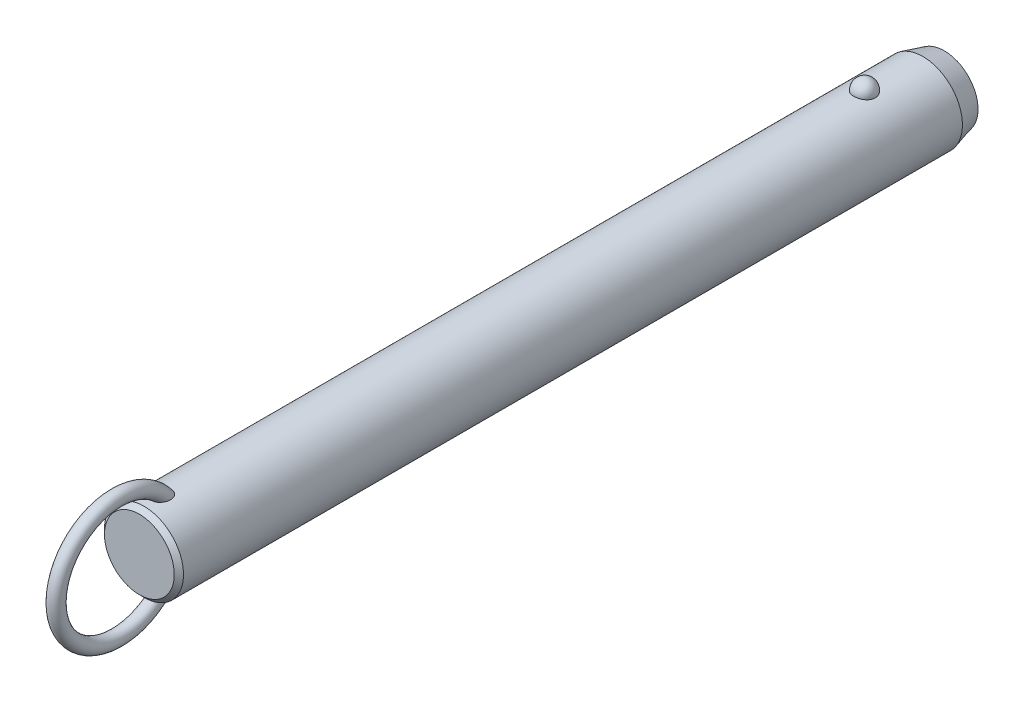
ISO-10303-21;
HEADER;
FILE_DESCRIPTION(('STEP AP214'),'2;1');
FILE_NAME('part.step','',(''),(''),'','','');
FILE_SCHEMA(('AUTOMOTIVE_DESIGN { 1 0 10303 214 1 1 1 1 }'));
ENDSEC;
DATA;
#1=APPLICATION_CONTEXT('core data for automotive mechanical design processes');
#2=APPLICATION_PROTOCOL_DEFINITION('international standard','automotive_design',2000,#1);
#3=PRODUCT_CONTEXT('',#1,'mechanical');
#4=PRODUCT('Part','Part','',(#3));
#5=PRODUCT_RELATED_PRODUCT_CATEGORY('part','',(#4));
#6=PRODUCT_DEFINITION_FORMATION('','',#4);
#7=PRODUCT_DEFINITION_CONTEXT('part definition',#1,'design');
#8=PRODUCT_DEFINITION('design','',#6,#7);
#9=PRODUCT_DEFINITION_SHAPE('','',#8);
#10=(LENGTH_UNIT() NAMED_UNIT(*) SI_UNIT(.MILLI.,.METRE.));
#11=(NAMED_UNIT(*) PLANE_ANGLE_UNIT() SI_UNIT($,.RADIAN.));
#12=(NAMED_UNIT(*) SI_UNIT($,.STERADIAN.) SOLID_ANGLE_UNIT());
#13=UNCERTAINTY_MEASURE_WITH_UNIT(LENGTH_MEASURE(1.E-05),#10,'distance_accuracy_value','');
#14=(GEOMETRIC_REPRESENTATION_CONTEXT(3) GLOBAL_UNCERTAINTY_ASSIGNED_CONTEXT((#13)) GLOBAL_UNIT_ASSIGNED_CONTEXT((#10,
#11,#12)) REPRESENTATION_CONTEXT('',''));
#15=CARTESIAN_POINT('',(0.,0.,0.));
#16=DIRECTION('',(0.,0.,1.));
#17=DIRECTION('',(1.,0.,0.));
#18=AXIS2_PLACEMENT_3D('',#15,#16,#17);
#19=CARTESIAN_POINT('',(0.,0.,188.));
#20=DIRECTION('',(0.,0.,-1.));
#21=DIRECTION('',(-1.,0.,0.));
#22=AXIS2_PLACEMENT_3D('',#19,#20,#21);
#23=CYLINDRICAL_SURFACE('',#22,11.1);
#24=CARTESIAN_POINT('',(2.9724815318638,10.6945945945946,-3.00000000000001));
#25=CARTESIAN_POINT('',(2.97247830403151,10.6945972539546,-2.8322505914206));
#26=CARTESIAN_POINT('',(2.95876598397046,10.6984356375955,-2.66445972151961));
#27=CARTESIAN_POINT('',(2.90424529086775,10.7133624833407,-2.3336238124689));
#28=CARTESIAN_POINT('',(2.8634252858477,10.7244540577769,-2.17058084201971));
#29=CARTESIAN_POINT('',(2.75573657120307,10.7526272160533,-1.85396767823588));
#30=CARTESIAN_POINT('',(2.68887937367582,10.7697061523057,-1.70039333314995));
#31=CARTESIAN_POINT('',(2.53079696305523,10.8079438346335,-1.4069159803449));
#32=CARTESIAN_POINT('',(2.43957264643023,10.8291024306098,-1.26701246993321));
#33=CARTESIAN_POINT('',(2.23458150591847,10.8732541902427,-1.00409565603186));
#34=CARTESIAN_POINT('',(2.12071295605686,10.8962553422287,-0.881162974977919));
#35=CARTESIAN_POINT('',(1.87365402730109,10.9414421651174,-0.656352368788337));
#36=CARTESIAN_POINT('',(1.74046358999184,10.9636278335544,-0.554474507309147));
#37=CARTESIAN_POINT('',(1.45872188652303,11.0046495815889,-0.374872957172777));
#38=CARTESIAN_POINT('',(1.31021276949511,11.0234944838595,-0.297085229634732));
#39=CARTESIAN_POINT('',(1.00170030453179,11.0557957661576,-0.167529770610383));
#40=CARTESIAN_POINT('',(0.841698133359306,11.0692526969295,-0.1157593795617));
#41=CARTESIAN_POINT('',(0.517607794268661,11.0890932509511,-0.0403925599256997));
#42=CARTESIAN_POINT('',(0.353633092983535,11.0955916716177,-0.0163383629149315));
#43=CARTESIAN_POINT('',(0.0238420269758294,11.1011989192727,0.00445177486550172));
#44=CARTESIAN_POINT('',(-0.141974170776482,11.1003084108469,0.00119017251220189));
#45=CARTESIAN_POINT('',(-0.468405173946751,11.0912990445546,-0.0323233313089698));
#46=CARTESIAN_POINT('',(-0.629059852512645,11.0832767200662,-0.062214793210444));
#47=CARTESIAN_POINT('',(-0.942937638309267,11.0609962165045,-0.147645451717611));
#48=CARTESIAN_POINT('',(-1.09616062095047,11.0467379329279,-0.203185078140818));
#49=CARTESIAN_POINT('',(-1.39181061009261,11.0134071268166,-0.338752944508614));
#50=CARTESIAN_POINT('',(-1.53417383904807,10.9943086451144,-0.418913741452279));
#51=CARTESIAN_POINT('',(-1.80342160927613,10.9533667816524,-0.601448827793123));
#52=CARTESIAN_POINT('',(-1.9303046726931,10.9315231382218,-0.703825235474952));
#53=CARTESIAN_POINT('',(-2.16747598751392,10.887005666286,-0.930091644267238));
#54=CARTESIAN_POINT('',(-2.27742774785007,10.8643239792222,-1.05433291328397));
#55=CARTESIAN_POINT('',(-2.47517316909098,10.8209886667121,-1.31966633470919));
#56=CARTESIAN_POINT('',(-2.56296538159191,10.8003351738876,-1.46075958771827));
#57=CARTESIAN_POINT('',(-2.71500300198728,10.7631304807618,-1.75753646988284));
#58=CARTESIAN_POINT('',(-2.77898901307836,10.7466250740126,-1.91335887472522));
#59=CARTESIAN_POINT('',(-2.88046189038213,10.7198747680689,-2.23391529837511));
#60=CARTESIAN_POINT('',(-2.91794947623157,10.709629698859,-2.3986490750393));
#61=CARTESIAN_POINT('',(-2.96537819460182,10.6965949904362,-2.73165170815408));
#62=CARTESIAN_POINT('',(-2.97542891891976,10.693775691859,-2.89990378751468));
#63=CARTESIAN_POINT('',(-2.96804271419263,10.6958279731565,-3.23575286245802));
#64=CARTESIAN_POINT('',(-2.95060646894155,10.7006993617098,-3.4033498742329));
#65=CARTESIAN_POINT('',(-2.88883358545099,10.71753912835,-3.73233906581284));
#66=CARTESIAN_POINT('',(-2.84462026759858,10.7294749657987,-3.89375610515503));
#67=CARTESIAN_POINT('',(-2.73050447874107,10.7590797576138,-4.20667949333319));
#68=CARTESIAN_POINT('',(-2.66060103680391,10.7767489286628,-4.35818546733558));
#69=CARTESIAN_POINT('',(-2.49642559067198,10.8159599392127,-4.64785421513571));
#70=CARTESIAN_POINT('',(-2.40203047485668,10.8375211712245,-4.78594458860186));
#71=CARTESIAN_POINT('',(-2.19143488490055,10.8820570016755,-5.04410382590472));
#72=CARTESIAN_POINT('',(-2.07523364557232,10.9050316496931,-5.16417205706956));
#73=CARTESIAN_POINT('',(-1.82361254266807,10.9499219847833,-5.3833483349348));
#74=CARTESIAN_POINT('',(-1.68812945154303,10.9718338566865,-5.48238464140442));
#75=CARTESIAN_POINT('',(-1.40191298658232,11.0120611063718,-5.65618873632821));
#76=CARTESIAN_POINT('',(-1.25118062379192,11.0303767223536,-5.73095813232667));
#77=CARTESIAN_POINT('',(-0.940570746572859,11.0611653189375,-5.85334725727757));
#78=CARTESIAN_POINT('',(-0.780821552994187,11.0737044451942,-5.90127578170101));
#79=CARTESIAN_POINT('',(-0.455204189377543,11.0918598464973,-5.96992976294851));
#80=CARTESIAN_POINT('',(-0.289336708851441,11.0974768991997,-5.99065827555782));
#81=CARTESIAN_POINT('',(0.0406846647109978,11.1011307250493,-6.00418773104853));
#82=CARTESIAN_POINT('',(0.204817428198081,11.099299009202,-5.9974731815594));
#83=CARTESIAN_POINT('',(0.5295530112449,11.088551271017,-5.95740317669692));
#84=CARTESIAN_POINT('',(0.69015594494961,11.0796354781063,-5.92404858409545));
#85=CARTESIAN_POINT('',(1.0027760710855,11.0557204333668,-5.83180084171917));
#86=CARTESIAN_POINT('',(1.15482001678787,11.0407414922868,-5.7729929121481));
#87=CARTESIAN_POINT('',(1.44678373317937,11.0062913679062,-5.63147366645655));
#88=CARTESIAN_POINT('',(1.58670279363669,10.9868199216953,-5.54876095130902));
#89=CARTESIAN_POINT('',(1.8527023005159,10.9451315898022,-5.36027644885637));
#90=CARTESIAN_POINT('',(1.97855158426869,10.9228788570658,-5.25418644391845));
#91=CARTESIAN_POINT('',(2.21080872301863,10.8782509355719,-5.02251354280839));
#92=CARTESIAN_POINT('',(2.31721312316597,10.8558757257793,-4.89692718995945));
#93=CARTESIAN_POINT('',(2.5094551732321,10.8130715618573,-4.62745408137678));
#94=CARTESIAN_POINT('',(2.59493284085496,10.7926798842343,-4.48330448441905));
#95=CARTESIAN_POINT('',(2.740862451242,10.7565495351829,-4.18236358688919));
#96=CARTESIAN_POINT('',(2.80132490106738,10.7408089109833,-4.02557762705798));
#97=CARTESIAN_POINT('',(2.88959070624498,10.7173718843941,-3.72475308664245));
#98=CARTESIAN_POINT('',(2.92062102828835,10.7088950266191,-3.58171216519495));
#99=CARTESIAN_POINT('',(2.96206765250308,10.6975052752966,-3.29245795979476));
#100=CARTESIAN_POINT('',(2.97248434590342,10.6945922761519,-3.14624473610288));
#101=CARTESIAN_POINT('',(2.9724815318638,10.6945945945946,-3.00000000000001));
#102=B_SPLINE_CURVE_WITH_KNOTS('',3,(#24,#25,#26,#27,#28,#29,#30,#31,#32,#33,#34,#35,#36,#37,
#38,#39,#40,#41,#42,#43,#44,#45,#46,#47,#48,#49,#50,#51,#52,#53,#54,#55,#56,#57,#58,#59,#60,#61,
#62,#63,#64,#65,#66,#67,#68,#69,#70,#71,#72,#73,#74,#75,#76,#77,#78,#79,#80,#81,#82,#83,#84,#85,
#86,#87,#88,#89,#90,#91,#92,#93,#94,#95,#96,#97,#98,#99,#100,#101),.UNSPECIFIED.,.T.,.F.,(4,2,2,
2,2,2,2,2,2,2,2,2,2,2,2,2,2,2,2,2,2,2,2,2,2,2,2,2,2,2,2,2,2,2,2,2,2,2,4),(0.,0.502722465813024,
1.00566079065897,1.5083769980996,2.01107471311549,2.51608392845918,3.02109467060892,
3.52475118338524,4.02835620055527,4.523518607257,5.0186364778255,5.50715297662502,
5.9956776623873,6.48688002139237,6.97812923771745,7.47814366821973,7.9781907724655,
8.48353712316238,8.9888697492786,9.49218093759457,9.99547960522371,10.4964777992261,
10.997494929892,11.5010810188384,12.0046847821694,12.5099796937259,13.0152411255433,
13.5145635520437,14.0138298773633,14.5043200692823,14.9947943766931,15.4836390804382,
15.9725123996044,16.4685040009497,16.9645836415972,17.4686765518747,17.972557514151,
18.410841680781,18.849117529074),.UNSPECIFIED.);
#103=CARTESIAN_POINT('',(2.9724815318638,10.6945945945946,-3.00000000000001));
#104=VERTEX_POINT('',#103);
#105=EDGE_CURVE('E41',#104,#104,#102,.T.);
#106=ORIENTED_EDGE('',*,*,#105,.T.);
#107=EDGE_LOOP('',(#106));
#108=FACE_BOUND('',#107,.T.);
#109=CARTESIAN_POINT('',(0.,0.,199.4));
#110=DIRECTION('',(0.,0.,1.));
#111=DIRECTION('',(1.,0.,0.));
#112=AXIS2_PLACEMENT_3D('',#109,#110,#111);
#113=CIRCLE('',#112,11.1);
#114=CARTESIAN_POINT('',(-11.1,0.,199.4));
#115=VERTEX_POINT('',#114);
#116=EDGE_CURVE('E10',#115,#115,#113,.F.);
#117=ORIENTED_EDGE('',*,*,#116,.T.);
#118=EDGE_LOOP('',(#117));
#119=FACE_BOUND('',#118,.T.);
#120=CARTESIAN_POINT('',(-0.564520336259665,-11.0856356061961,191.657815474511));
#121=CARTESIAN_POINT('',(-0.667202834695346,-11.0804062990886,191.691283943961));
#122=CARTESIAN_POINT('',(-0.766875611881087,-11.0738877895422,191.733835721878));
#123=CARTESIAN_POINT('',(-0.95728412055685,-11.0590576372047,191.835419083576));
#124=CARTESIAN_POINT('',(-1.04801616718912,-11.0507452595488,191.89445742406));
#125=CARTESIAN_POINT('',(-1.21800952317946,-11.0333016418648,192.026529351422));
#126=CARTESIAN_POINT('',(-1.29730805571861,-11.0241732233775,192.099515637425));
#127=CARTESIAN_POINT('',(-1.44337665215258,-11.0060026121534,192.257037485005));
#128=CARTESIAN_POINT('',(-1.51014622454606,-10.9969604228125,192.341573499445));
#129=CARTESIAN_POINT('',(-1.63454620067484,-10.9791841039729,192.525521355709));
#130=CARTESIAN_POINT('',(-1.69127003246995,-10.9705107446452,192.625549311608));
#131=CARTESIAN_POINT('',(-1.7898078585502,-10.9548648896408,192.832790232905));
#132=CARTESIAN_POINT('',(-1.83161214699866,-10.9478935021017,192.940007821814));
#133=CARTESIAN_POINT('',(-1.91557028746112,-10.9335803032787,193.205408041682));
#134=CARTESIAN_POINT('',(-1.95040620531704,-10.9273269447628,193.365980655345));
#135=CARTESIAN_POINT('',(-1.99388326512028,-10.9194709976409,193.690697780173));
#136=CARTESIAN_POINT('',(-2.00248051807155,-10.9178762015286,193.854847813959));
#137=CARTESIAN_POINT('',(-1.99551615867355,-10.9191578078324,194.224650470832));
#138=CARTESIAN_POINT('',(-1.9732206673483,-10.9232807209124,194.430191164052));
#139=CARTESIAN_POINT('',(-1.9152976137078,-10.9335244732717,194.733595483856));
#140=CARTESIAN_POINT('',(-1.89184575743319,-10.9376266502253,194.834088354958));
#141=CARTESIAN_POINT('',(-1.83700674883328,-10.9469720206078,195.032855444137));
#142=CARTESIAN_POINT('',(-1.80562070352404,-10.9522150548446,195.131129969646));
#143=CARTESIAN_POINT('',(-1.73463055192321,-10.9636837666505,195.325914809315));
#144=CARTESIAN_POINT('',(-1.69493416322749,-10.9699202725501,195.422390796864));
#145=CARTESIAN_POINT('',(-1.60745141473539,-10.9830806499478,195.611626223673));
#146=CARTESIAN_POINT('',(-1.55966150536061,-10.9900048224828,195.704384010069));
#147=CARTESIAN_POINT('',(-1.45591812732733,-11.0042280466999,195.884690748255));
#148=CARTESIAN_POINT('',(-1.40000013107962,-11.0115253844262,195.972260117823));
#149=CARTESIAN_POINT('',(-1.27937470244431,-11.0261911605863,196.141029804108));
#150=CARTESIAN_POINT('',(-1.21467835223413,-11.0335594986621,196.22223795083));
#151=CARTESIAN_POINT('',(-1.08218150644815,-11.0473027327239,196.369001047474));
#152=CARTESIAN_POINT('',(-1.01522633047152,-11.0537063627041,196.435309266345));
#153=CARTESIAN_POINT('',(-0.872952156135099,-11.065850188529,196.558378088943));
#154=CARTESIAN_POINT('',(-0.797642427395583,-11.0715911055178,196.615149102));
#155=CARTESIAN_POINT('',(-0.651396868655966,-11.081071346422,196.707515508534));
#156=CARTESIAN_POINT('',(-0.581712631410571,-11.0849841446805,196.745049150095));
#157=CARTESIAN_POINT('',(-0.437066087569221,-11.0916271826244,196.808259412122));
#158=CARTESIAN_POINT('',(-0.362109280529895,-11.0943586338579,196.833948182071));
#159=CARTESIAN_POINT('',(-0.207828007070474,-11.0983242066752,196.871117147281));
#160=CARTESIAN_POINT('',(-0.12846771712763,-11.0995432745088,196.882454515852));
#161=CARTESIAN_POINT('',(0.0309101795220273,-11.1002423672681,196.888965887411));
#162=CARTESIAN_POINT('',(0.110927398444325,-11.0997233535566,196.884148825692));
#163=CARTESIAN_POINT('',(0.25640659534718,-11.097240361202,196.860959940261));
#164=CARTESIAN_POINT('',(0.322235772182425,-11.0955074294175,196.844754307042));
#165=CARTESIAN_POINT('',(0.450635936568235,-11.0910350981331,196.802600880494));
#166=CARTESIAN_POINT('',(0.513205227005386,-11.0882951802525,196.776648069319));
#167=CARTESIAN_POINT('',(0.662626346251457,-11.0805620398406,196.702607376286));
#168=CARTESIAN_POINT('',(0.747127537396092,-11.0751144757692,196.649845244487));
#169=CARTESIAN_POINT('',(0.906756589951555,-11.0631932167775,196.531720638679));
#170=CARTESIAN_POINT('',(0.981859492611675,-11.0567168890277,196.466325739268));
#171=CARTESIAN_POINT('',(1.10712207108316,-11.0447856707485,196.34226337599));
#172=CARTESIAN_POINT('',(1.15909566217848,-11.0394280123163,196.285383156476));
#173=CARTESIAN_POINT('',(1.25791923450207,-11.0286040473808,196.167327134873));
#174=CARTESIAN_POINT('',(1.30476642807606,-11.0231376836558,196.106149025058));
#175=CARTESIAN_POINT('',(1.43818612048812,-11.0068027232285,195.917305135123));
#176=CARTESIAN_POINT('',(1.51751767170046,-10.9960104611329,195.784453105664));
#177=CARTESIAN_POINT('',(1.63597546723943,-10.9788847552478,195.553137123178));
#178=CARTESIAN_POINT('',(1.67988876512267,-10.9722190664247,195.457053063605));
#179=CARTESIAN_POINT('',(1.75953241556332,-10.9597298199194,195.261431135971));
#180=CARTESIAN_POINT('',(1.7952596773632,-10.9539065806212,195.161891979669));
#181=CARTESIAN_POINT('',(1.85844731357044,-10.9433632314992,194.96021118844));
#182=CARTESIAN_POINT('',(1.88591073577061,-10.9386427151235,194.85807052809));
#183=CARTESIAN_POINT('',(1.93234324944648,-10.9305350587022,194.651819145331));
#184=CARTESIAN_POINT('',(1.95131065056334,-10.9271481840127,194.547708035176));
#185=CARTESIAN_POINT('',(1.9904020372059,-10.9201183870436,194.265458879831));
#186=CARTESIAN_POINT('',(2.00221217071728,-10.9179256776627,194.086037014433));
#187=CARTESIAN_POINT('',(1.99711676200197,-10.9188636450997,193.727713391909));
#188=CARTESIAN_POINT('',(1.98026150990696,-10.9219849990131,193.548811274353));
#189=CARTESIAN_POINT('',(1.92151657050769,-10.9324473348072,193.23645144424));
#190=CARTESIAN_POINT('',(1.88605081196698,-10.9386915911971,193.101759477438));
#191=CARTESIAN_POINT('',(1.79393020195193,-10.9541780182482,192.839966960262));
#192=CARTESIAN_POINT('',(1.73729868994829,-10.9634168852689,192.712858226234));
#193=CARTESIAN_POINT('',(1.61237037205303,-10.9824218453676,192.489418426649));
#194=CARTESIAN_POINT('',(1.54715374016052,-10.9918945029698,192.391345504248));
#195=CARTESIAN_POINT('',(1.40127026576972,-11.0114415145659,192.207434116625));
#196=CARTESIAN_POINT('',(1.32060742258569,-11.0215157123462,192.121592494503));
#197=CARTESIAN_POINT('',(1.1447478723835,-11.041168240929,191.965163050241));
#198=CARTESIAN_POINT('',(1.04947805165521,-11.0507437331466,191.894656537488));
#199=CARTESIAN_POINT('',(0.847278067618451,-11.0680789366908,191.772640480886));
#200=CARTESIAN_POINT('',(0.74035174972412,-11.0758392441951,191.721124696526));
#201=CARTESIAN_POINT('',(0.529289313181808,-11.0878275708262,191.643485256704));
#202=CARTESIAN_POINT('',(0.425895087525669,-11.0923259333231,191.615377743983));
#203=CARTESIAN_POINT('',(0.215723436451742,-11.0984001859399,191.577703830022));
#204=CARTESIAN_POINT('',(0.108947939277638,-11.0999777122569,191.568127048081));
#205=CARTESIAN_POINT('',(-0.0938962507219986,-11.1000196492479,191.567877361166));
#206=CARTESIAN_POINT('',(-0.189967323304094,-11.0987797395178,191.575408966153));
#207=CARTESIAN_POINT('',(-0.379657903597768,-11.0939111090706,191.605507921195));
#208=CARTESIAN_POINT('',(-0.47327735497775,-11.0902823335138,191.628075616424));
#209=CARTESIAN_POINT('',(-0.564520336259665,-11.0856356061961,191.657815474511));
#210=B_SPLINE_CURVE_WITH_KNOTS('',3,(#120,#121,#122,#123,#124,#125,#126,#127,#128,#129,#130,
#131,#132,#133,#134,#135,#136,#137,#138,#139,#140,#141,#142,#143,#144,#145,#146,#147,#148,#149,
#150,#151,#152,#153,#154,#155,#156,#157,#158,#159,#160,#161,#162,#163,#164,#165,#166,#167,#168,
#169,#170,#171,#172,#173,#174,#175,#176,#177,#178,#179,#180,#181,#182,#183,#184,#185,#186,#187,
#188,#189,#190,#191,#192,#193,#194,#195,#196,#197,#198,#199,#200,#201,#202,#203,#204,#205,#206,
#207,#208,#209),.UNSPECIFIED.,.T.,.F.,(4,2,2,2,2,2,2,2,2,2,2,2,2,2,2,2,2,2,2,2,2,2,2,2,2,2,2,2,
2,2,2,2,2,2,2,2,2,2,2,2,2,2,2,2,4),(0.,0.323999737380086,0.64813245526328,0.97118486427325,
1.29424994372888,1.63886237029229,1.98369857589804,2.47426059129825,2.96564271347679,
3.58257396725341,3.89215258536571,4.20168803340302,4.51486273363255,4.82817514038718,
5.14015911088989,5.45175282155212,5.73442856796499,6.01679375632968,6.2536458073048,
6.49025437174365,6.7291996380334,6.96801276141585,7.17061258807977,7.37331685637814,
7.67094989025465,7.96935728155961,8.2007506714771,8.4322692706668,8.89581623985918,
9.21306533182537,9.53043400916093,9.84768549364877,10.1650000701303,10.7022930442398,
11.2386443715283,11.655339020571,12.071575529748,12.4245637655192,12.7774607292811,
13.1321855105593,13.4867936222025,13.8068771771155,14.1267813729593,14.4146787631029,
14.7025827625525),.UNSPECIFIED.);
#211=CARTESIAN_POINT('',(-0.564520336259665,-11.0856356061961,191.657815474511));
#212=VERTEX_POINT('',#211);
#213=EDGE_CURVE('E59',#212,#212,#210,.T.);
#214=ORIENTED_EDGE('',*,*,#213,.T.);
#215=EDGE_LOOP('',(#214));
#216=FACE_BOUND('',#215,.T.);
#217=CARTESIAN_POINT('',(-0.564520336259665,11.0856356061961,191.657815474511));
#218=CARTESIAN_POINT('',(-0.468542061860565,11.0905203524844,191.626545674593));
#219=CARTESIAN_POINT('',(-0.369793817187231,11.0942886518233,191.603157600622));
#220=CARTESIAN_POINT('',(-0.169555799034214,11.0991586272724,191.573085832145));
#221=CARTESIAN_POINT('',(-0.0680604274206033,11.1002543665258,191.56643932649));
#222=CARTESIAN_POINT('',(0.134549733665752,11.099646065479,191.570157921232));
#223=CARTESIAN_POINT('',(0.235664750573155,11.0979441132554,191.58051033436));
#224=CARTESIAN_POINT('',(0.434632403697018,11.0919342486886,191.617831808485));
#225=CARTESIAN_POINT('',(0.532486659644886,11.0876276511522,191.644792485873));
#226=CARTESIAN_POINT('',(0.722445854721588,11.0768742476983,191.7144096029));
#227=CARTESIAN_POINT('',(0.814543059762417,11.0704246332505,191.757086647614));
#228=CARTESIAN_POINT('',(0.990565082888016,11.0560659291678,191.856648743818));
#229=CARTESIAN_POINT('',(1.07448844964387,11.048156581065,191.913536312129));
#230=CARTESIAN_POINT('',(1.23562672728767,11.0313221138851,192.042210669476));
#231=CARTESIAN_POINT('',(1.3124268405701,11.0223686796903,192.114511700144));
#232=CARTESIAN_POINT('',(1.45398030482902,11.0045918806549,192.270042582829));
#233=CARTESIAN_POINT('',(1.51873073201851,10.9957685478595,192.353275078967));
#234=CARTESIAN_POINT('',(1.64107232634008,10.9782087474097,192.536384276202));
#235=CARTESIAN_POINT('',(1.6974317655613,10.9695572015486,192.637089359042));
#236=CARTESIAN_POINT('',(1.79515063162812,10.9539887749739,192.845626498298));
#237=CARTESIAN_POINT('',(1.83649966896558,10.9470730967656,192.95346343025));
#238=CARTESIAN_POINT('',(1.91931148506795,10.9329211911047,193.220399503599));
#239=CARTESIAN_POINT('',(1.95340104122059,10.9267904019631,193.381861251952));
#240=CARTESIAN_POINT('',(1.99526195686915,10.9192174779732,193.70821631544));
#241=CARTESIAN_POINT('',(2.00298989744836,10.9177830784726,193.87311484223));
#242=CARTESIAN_POINT('',(1.99396251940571,10.9194420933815,194.244100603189));
#243=CARTESIAN_POINT('',(1.97050829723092,10.923774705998,194.45003871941));
#244=CARTESIAN_POINT('',(1.91079643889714,10.9343131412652,194.753901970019));
#245=CARTESIAN_POINT('',(1.88673702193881,10.9385106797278,194.854529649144));
#246=CARTESIAN_POINT('',(1.83065508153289,10.9480376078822,195.053510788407));
#247=CARTESIAN_POINT('',(1.79863369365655,10.9533668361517,195.151864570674));
#248=CARTESIAN_POINT('',(1.72633365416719,10.9649954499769,195.346720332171));
#249=CARTESIAN_POINT('',(1.68596409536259,10.9713053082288,195.44318790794));
#250=CARTESIAN_POINT('',(1.59707998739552,10.9845964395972,195.632323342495));
#251=CARTESIAN_POINT('',(1.54856169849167,10.9915780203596,195.724989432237));
#252=CARTESIAN_POINT('',(1.44330168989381,11.0058935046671,195.904975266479));
#253=CARTESIAN_POINT('',(1.3865974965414,11.0132257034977,195.992316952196));
#254=CARTESIAN_POINT('',(1.2643115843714,11.0279330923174,196.160456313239));
#255=CARTESIAN_POINT('',(1.19874160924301,11.0353082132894,196.241262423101));
#256=CARTESIAN_POINT('',(1.06542088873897,11.048931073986,196.385985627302));
#257=CARTESIAN_POINT('',(0.998640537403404,11.0552153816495,196.450784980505));
#258=CARTESIAN_POINT('',(0.856896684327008,11.0671032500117,196.570846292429));
#259=CARTESIAN_POINT('',(0.781942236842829,11.0727075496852,196.626118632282));
#260=CARTESIAN_POINT('',(0.636276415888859,11.081949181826,196.715972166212));
#261=CARTESIAN_POINT('',(0.566755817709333,11.0857572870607,196.752441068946));
#262=CARTESIAN_POINT('',(0.422602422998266,11.0921860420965,196.813533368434));
#263=CARTESIAN_POINT('',(0.347974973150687,11.0948079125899,196.838168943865));
#264=CARTESIAN_POINT('',(0.194593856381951,11.0985608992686,196.873323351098));
#265=CARTESIAN_POINT('',(0.115807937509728,11.0996777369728,196.883706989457));
#266=CARTESIAN_POINT('',(-0.0422499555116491,11.1002003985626,196.888574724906));
#267=CARTESIAN_POINT('',(-0.121521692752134,11.09960699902,196.883066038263));
#268=CARTESIAN_POINT('',(-0.266046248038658,11.0970123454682,196.858827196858));
#269=CARTESIAN_POINT('',(-0.331661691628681,11.0952283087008,196.842135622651));
#270=CARTESIAN_POINT('',(-0.459588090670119,11.0906663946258,196.799111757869));
#271=CARTESIAN_POINT('',(-0.52189737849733,11.0878880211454,196.772774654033));
#272=CARTESIAN_POINT('',(-0.671446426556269,11.0800342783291,196.697513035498));
#273=CARTESIAN_POINT('',(-0.756250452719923,11.0744969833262,196.643818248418));
#274=CARTESIAN_POINT('',(-0.916349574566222,11.0624045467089,196.523802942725));
#275=CARTESIAN_POINT('',(-0.991618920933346,11.0558467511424,196.457449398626));
#276=CARTESIAN_POINT('',(-1.11713140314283,11.0437783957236,196.331633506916));
#277=CARTESIAN_POINT('',(-1.16920539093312,11.0383619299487,196.273952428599));
#278=CARTESIAN_POINT('',(-1.26817476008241,11.02743010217,196.154280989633));
#279=CARTESIAN_POINT('',(-1.31506731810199,11.0219146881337,196.092288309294));
#280=CARTESIAN_POINT('',(-1.40399813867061,11.0109399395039,195.964784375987));
#281=CARTESIAN_POINT('',(-1.44602864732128,11.0054807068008,195.899267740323));
#282=CARTESIAN_POINT('',(-1.52538779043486,10.9947621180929,195.765422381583));
#283=CARTESIAN_POINT('',(-1.56271516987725,10.9895028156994,195.697092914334));
#284=CARTESIAN_POINT('',(-1.64537943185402,10.9774790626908,195.533210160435));
#285=CARTESIAN_POINT('',(-1.68879497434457,10.9708503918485,195.4366735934));
#286=CARTESIAN_POINT('',(-1.76740738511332,10.9584602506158,195.240236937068));
#287=CARTESIAN_POINT('',(-1.80260120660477,10.95269910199,195.14033561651));
#288=CARTESIAN_POINT('',(-1.86468657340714,10.9423003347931,194.937966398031));
#289=CARTESIAN_POINT('',(-1.8915816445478,10.9376622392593,194.835499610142));
#290=CARTESIAN_POINT('',(-1.93682458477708,10.9297405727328,194.628642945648));
#291=CARTESIAN_POINT('',(-1.95517082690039,10.9264572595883,194.524252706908));
#292=CARTESIAN_POINT('',(-1.99232562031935,10.9197647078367,194.24262876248));
#293=CARTESIAN_POINT('',(-2.00294603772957,10.9177914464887,194.064185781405));
#294=CARTESIAN_POINT('',(-1.99566675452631,10.9191290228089,193.707996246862));
#295=CARTESIAN_POINT('',(-1.97781651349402,10.9224306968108,193.53024902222));
#296=CARTESIAN_POINT('',(-1.91747214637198,10.9331592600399,193.219792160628));
#297=CARTESIAN_POINT('',(-1.88131022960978,10.9395108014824,193.085825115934));
#298=CARTESIAN_POINT('',(-1.78790380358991,10.9551659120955,192.82559757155));
#299=CARTESIAN_POINT('',(-1.73068309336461,10.9644661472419,192.699328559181));
#300=CARTESIAN_POINT('',(-1.60475573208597,10.9835398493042,192.47741565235));
#301=CARTESIAN_POINT('',(-1.53908879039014,10.9930297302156,192.380026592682));
#302=CARTESIAN_POINT('',(-1.39238608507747,11.0125708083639,192.197525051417));
#303=CARTESIAN_POINT('',(-1.31135150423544,11.0226219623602,192.112411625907));
#304=CARTESIAN_POINT('',(-1.14382035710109,11.0411991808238,191.96529943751));
#305=CARTESIAN_POINT('',(-1.0585850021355,11.0497792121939,191.90186930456));
#306=CARTESIAN_POINT('',(-0.878723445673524,11.0655285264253,191.790250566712));
#307=CARTESIAN_POINT('',(-0.784123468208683,11.0727015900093,191.742020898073));
#308=CARTESIAN_POINT('',(-0.646163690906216,11.0812501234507,191.686023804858));
#309=CARTESIAN_POINT('',(-0.605595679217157,11.0835451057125,191.671197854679));
#310=CARTESIAN_POINT('',(-0.564520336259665,11.0856356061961,191.657815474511));
#311=B_SPLINE_CURVE_WITH_KNOTS('',3,(#217,#218,#219,#220,#221,#222,#223,#224,#225,#226,#227,
#228,#229,#230,#231,#232,#233,#234,#235,#236,#237,#238,#239,#240,#241,#242,#243,#244,#245,#246,
#247,#248,#249,#250,#251,#252,#253,#254,#255,#256,#257,#258,#259,#260,#261,#262,#263,#264,#265,
#266,#267,#268,#269,#270,#271,#272,#273,#274,#275,#276,#277,#278,#279,#280,#281,#282,#283,#284,
#285,#286,#287,#288,#289,#290,#291,#292,#293,#294,#295,#296,#297,#298,#299,#300,#301,#302,#303,
#304,#305,#306,#307,#308,#309,#310),.UNSPECIFIED.,.T.,.F.,(4,2,2,2,2,2,2,2,2,2,2,2,2,2,2,2,2,2,
2,2,2,2,2,2,2,2,2,2,2,2,2,2,2,2,2,2,2,2,2,2,2,2,2,2,2,2,4),(0.,0.303061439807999,
0.606795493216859,0.910302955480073,1.21365733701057,1.51741085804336,1.82121821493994,
2.13745205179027,2.45376252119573,2.79958678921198,3.14564996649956,3.63832391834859,
4.13180893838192,4.75031912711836,5.06071926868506,5.37107516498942,5.6850077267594,
5.99908475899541,6.31176519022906,6.62403542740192,6.90315673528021,7.18197194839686,
7.41687778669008,7.65154134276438,7.88841587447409,8.12518286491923,8.32752842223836,
8.52997509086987,8.82986421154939,9.13054668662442,9.36393502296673,9.5974499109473,
9.83133221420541,10.0652767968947,10.383032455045,10.7009056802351,11.0186436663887,
11.3364420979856,11.8705925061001,12.4038159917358,12.8189662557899,13.2336487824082,
13.5857049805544,13.9377340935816,14.2561354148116,14.5736690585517,14.7033687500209),.UNSPECIFIED.);
#312=CARTESIAN_POINT('',(-0.564520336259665,11.0856356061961,191.657815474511));
#313=VERTEX_POINT('',#312);
#314=EDGE_CURVE('E67',#313,#313,#311,.T.);
#315=ORIENTED_EDGE('',*,*,#314,.T.);
#316=EDGE_LOOP('',(#315));
#317=FACE_BOUND('',#316,.T.);
#318=CARTESIAN_POINT('',(0.,0.,-19.3999999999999));
#319=DIRECTION('',(0.,0.,-1.));
#320=DIRECTION('',(-1.,0.,0.));
#321=AXIS2_PLACEMENT_3D('',#318,#319,#320);
#322=CIRCLE('',#321,11.1);
#323=CARTESIAN_POINT('',(-11.1,0.,-19.3999999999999));
#324=VERTEX_POINT('',#323);
#325=EDGE_CURVE('E56',#324,#324,#322,.F.);
#326=ORIENTED_EDGE('',*,*,#325,.T.);
#327=EDGE_LOOP('',(#326));
#328=FACE_BOUND('',#327,.T.);
#329=ADVANCED_FACE('F37',(#108,#119,#216,#317,#328),#23,.T.);
#330=CARTESIAN_POINT('',(0.,0.,-25.4));
#331=DIRECTION('',(0.,0.,-1.));
#332=DIRECTION('',(-1.,0.,0.));
#333=AXIS2_PLACEMENT_3D('',#330,#331,#332);
#334=PLANE('',#333);
#335=CARTESIAN_POINT('',(0.,0.,-25.4));
#336=DIRECTION('',(0.,0.,-1.));
#337=DIRECTION('',(-1.,0.,0.));
#338=AXIS2_PLACEMENT_3D('',#335,#336,#337);
#339=CIRCLE('',#338,9.49230484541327);
#340=CARTESIAN_POINT('',(-9.49230484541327,0.,-25.4));
#341=VERTEX_POINT('',#340);
#342=EDGE_CURVE('E66',#341,#341,#339,.T.);
#343=ORIENTED_EDGE('',*,*,#342,.T.);
#344=EDGE_LOOP('',(#343));
#345=FACE_BOUND('',#344,.T.);
#346=ADVANCED_FACE('F85',(#345),#334,.T.);
#347=CARTESIAN_POINT('',(0.,0.,-25.4));
#348=DIRECTION('',(0.,0.,1.));
#349=DIRECTION('',(1.,0.,0.));
#350=AXIS2_PLACEMENT_3D('',#347,#348,#349);
#351=CONICAL_SURFACE('',#350,9.49230484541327,0.261799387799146);
#352=ORIENTED_EDGE('',*,*,#325,.F.);
#353=EDGE_LOOP('',(#352));
#354=FACE_BOUND('',#353,.T.);
#355=ORIENTED_EDGE('',*,*,#342,.F.);
#356=EDGE_LOOP('',(#355));
#357=FACE_BOUND('',#356,.T.);
#358=ADVANCED_FACE('F83',(#354,#357),#351,.T.);
#359=CARTESIAN_POINT('',(0.,0.,200.7));
#360=DIRECTION('',(0.,0.,1.));
#361=DIRECTION('',(1.,0.,0.));
#362=AXIS2_PLACEMENT_3D('',#359,#360,#361);
#363=PLANE('',#362);
#364=CARTESIAN_POINT('',(0.,0.,200.7));
#365=DIRECTION('',(0.,0.,1.));
#366=DIRECTION('',(1.,0.,0.));
#367=AXIS2_PLACEMENT_3D('',#364,#365,#366);
#368=CIRCLE('',#367,9.79999999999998);
#369=CARTESIAN_POINT('',(-9.79999999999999,0.,200.7));
#370=VERTEX_POINT('',#369);
#371=EDGE_CURVE('E50',#370,#370,#368,.T.);
#372=ORIENTED_EDGE('',*,*,#371,.T.);
#373=EDGE_LOOP('',(#372));
#374=FACE_BOUND('',#373,.T.);
#375=ADVANCED_FACE('F77',(#374),#363,.T.);
#376=CARTESIAN_POINT('',(0.,0.,207.05));
#377=DIRECTION('',(1.,0.,0.));
#378=DIRECTION('',(0.,0.,-1.));
#379=AXIS2_PLACEMENT_3D('',#376,#377,#378);
#380=TOROIDAL_SURFACE('',#379,17.05,2.);
#381=ORIENTED_EDGE('',*,*,#314,.F.);
#382=EDGE_LOOP('',(#381));
#383=FACE_BOUND('',#382,.T.);
#384=ORIENTED_EDGE('',*,*,#213,.F.);
#385=EDGE_LOOP('',(#384));
#386=FACE_BOUND('',#385,.T.);
#387=ADVANCED_FACE('F73',(#383,#386),#380,.T.);
#388=CARTESIAN_POINT('',(0.,0.,200.7));
#389=DIRECTION('',(0.,0.,-1.));
#390=DIRECTION('',(-1.,0.,0.));
#391=AXIS2_PLACEMENT_3D('',#388,#389,#390);
#392=CONICAL_SURFACE('',#391,9.79999999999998,0.785398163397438);
#393=CARTESIAN_POINT('',(-11.1,0.,199.4));
#394=CARTESIAN_POINT('',(-11.0864583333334,0.,199.413541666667));
#395=CARTESIAN_POINT('',(-11.0729166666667,0.,199.427083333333));
#396=CARTESIAN_POINT('',(-11.0458333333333,0.,199.454166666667));
#397=CARTESIAN_POINT('',(-11.0322916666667,0.,199.467708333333));
#398=CARTESIAN_POINT('',(-11.0052083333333,0.,199.494791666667));
#399=CARTESIAN_POINT('',(-10.9916666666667,0.,199.508333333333));
#400=CARTESIAN_POINT('',(-10.9645833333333,0.,199.535416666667));
#401=CARTESIAN_POINT('',(-10.9510416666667,0.,199.548958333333));
#402=CARTESIAN_POINT('',(-10.9239583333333,0.,199.576041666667));
#403=CARTESIAN_POINT('',(-10.9104166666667,0.,199.589583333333));
#404=CARTESIAN_POINT('',(-10.8833333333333,0.,199.616666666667));
#405=CARTESIAN_POINT('',(-10.8697916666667,0.,199.630208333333));
#406=CARTESIAN_POINT('',(-10.8427083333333,0.,199.657291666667));
#407=CARTESIAN_POINT('',(-10.8291666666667,0.,199.670833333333));
#408=CARTESIAN_POINT('',(-10.8020833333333,0.,199.697916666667));
#409=CARTESIAN_POINT('',(-10.7885416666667,0.,199.711458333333));
#410=CARTESIAN_POINT('',(-10.7614583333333,0.,199.738541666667));
#411=CARTESIAN_POINT('',(-10.7479166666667,0.,199.752083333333));
#412=CARTESIAN_POINT('',(-10.7208333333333,0.,199.779166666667));
#413=CARTESIAN_POINT('',(-10.7072916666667,0.,199.792708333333));
#414=CARTESIAN_POINT('',(-10.6802083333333,0.,199.819791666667));
#415=CARTESIAN_POINT('',(-10.6666666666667,0.,199.833333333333));
#416=CARTESIAN_POINT('',(-10.6395833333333,0.,199.860416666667));
#417=CARTESIAN_POINT('',(-10.6260416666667,0.,199.873958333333));
#418=CARTESIAN_POINT('',(-10.5989583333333,0.,199.901041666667));
#419=CARTESIAN_POINT('',(-10.5854166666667,0.,199.914583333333));
#420=CARTESIAN_POINT('',(-10.5583333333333,0.,199.941666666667));
#421=CARTESIAN_POINT('',(-10.5447916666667,0.,199.955208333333));
#422=CARTESIAN_POINT('',(-10.5177083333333,0.,199.982291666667));
#423=CARTESIAN_POINT('',(-10.5041666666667,0.,199.995833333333));
#424=CARTESIAN_POINT('',(-10.4770833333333,0.,200.022916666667));
#425=CARTESIAN_POINT('',(-10.4635416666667,0.,200.036458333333));
#426=CARTESIAN_POINT('',(-10.4364583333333,0.,200.063541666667));
#427=CARTESIAN_POINT('',(-10.4229166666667,0.,200.077083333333));
#428=CARTESIAN_POINT('',(-10.3958333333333,0.,200.104166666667));
#429=CARTESIAN_POINT('',(-10.3822916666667,0.,200.117708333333));
#430=CARTESIAN_POINT('',(-10.3552083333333,0.,200.144791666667));
#431=CARTESIAN_POINT('',(-10.3416666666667,0.,200.158333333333));
#432=CARTESIAN_POINT('',(-10.3145833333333,0.,200.185416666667));
#433=CARTESIAN_POINT('',(-10.3010416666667,0.,200.198958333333));
#434=CARTESIAN_POINT('',(-10.2739583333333,0.,200.226041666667));
#435=CARTESIAN_POINT('',(-10.2604166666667,0.,200.239583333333));
#436=CARTESIAN_POINT('',(-10.2333333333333,0.,200.266666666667));
#437=CARTESIAN_POINT('',(-10.2197916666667,0.,200.280208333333));
#438=CARTESIAN_POINT('',(-10.1927083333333,0.,200.307291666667));
#439=CARTESIAN_POINT('',(-10.1791666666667,0.,200.320833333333));
#440=CARTESIAN_POINT('',(-10.1520833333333,0.,200.347916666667));
#441=CARTESIAN_POINT('',(-10.1385416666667,0.,200.361458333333));
#442=CARTESIAN_POINT('',(-10.1114583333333,0.,200.388541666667));
#443=CARTESIAN_POINT('',(-10.0979166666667,0.,200.402083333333));
#444=CARTESIAN_POINT('',(-10.0708333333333,0.,200.429166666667));
#445=CARTESIAN_POINT('',(-10.0572916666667,0.,200.442708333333));
#446=CARTESIAN_POINT('',(-10.0302083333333,0.,200.469791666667));
#447=CARTESIAN_POINT('',(-10.0166666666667,0.,200.483333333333));
#448=CARTESIAN_POINT('',(-9.98958333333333,0.,200.510416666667));
#449=CARTESIAN_POINT('',(-9.97604166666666,0.,200.523958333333));
#450=CARTESIAN_POINT('',(-9.94895833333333,0.,200.551041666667));
#451=CARTESIAN_POINT('',(-9.93541666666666,0.,200.564583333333));
#452=CARTESIAN_POINT('',(-9.90833333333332,0.,200.591666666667));
#453=CARTESIAN_POINT('',(-9.89479166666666,0.,200.605208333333));
#454=CARTESIAN_POINT('',(-9.86770833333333,0.,200.632291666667));
#455=CARTESIAN_POINT('',(-9.85416666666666,0.,200.645833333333));
#456=CARTESIAN_POINT('',(-9.82708333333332,0.,200.672916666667));
#457=CARTESIAN_POINT('',(-9.81354166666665,0.,200.686458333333));
#458=CARTESIAN_POINT('',(-9.79999999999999,0.,200.7));
#459=B_SPLINE_CURVE_WITH_KNOTS('',3,(#393,#394,#395,#396,#397,#398,#399,#400,#401,#402,#403,
#404,#405,#406,#407,#408,#409,#410,#411,#412,#413,#414,#415,#416,#417,#418,#419,#420,#421,#422,
#423,#424,#425,#426,#427,#428,#429,#430,#431,#432,#433,#434,#435,#436,#437,#438,#439,#440,#441,
#442,#443,#444,#445,#446,#447,#448,#449,#450,#451,#452,#453,#454,#455,#456,#457,#458),
.UNSPECIFIED.,.F.,.F.,(4,2,2,2,2,2,2,2,2,2,2,2,2,2,2,2,2,2,2,2,2,2,2,2,2,2,2,2,2,2,2,2,4),(0.,
0.0574524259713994,0.114904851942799,0.172357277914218,0.229809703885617,0.287262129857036,
0.344714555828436,0.402166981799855,0.459619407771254,0.517071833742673,0.574524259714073,
0.631976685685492,0.689429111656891,0.74688153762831,0.80433396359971,0.861786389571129,
0.91923881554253,0.976691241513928,1.03414366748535,1.09159609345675,1.14904851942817,
1.20650094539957,1.26395337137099,1.32140579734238,1.3788582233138,1.4363106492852,
1.49376307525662,1.55121550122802,1.60866792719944,1.66612035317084,1.72357277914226,
1.78102520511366,1.83847763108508),.UNSPECIFIED.);
#460=EDGE_CURVE('BSEAM39',#115,#370,#459,.T.);
#461=ORIENTED_EDGE('',*,*,#116,.F.);
#462=ORIENTED_EDGE('',*,*,#371,.F.);
#463=ORIENTED_EDGE('',*,*,#460,.T.);
#464=ORIENTED_EDGE('',*,*,#460,.F.);
#465=EDGE_LOOP('',(#461,#463,#462,#464));
#466=FACE_BOUND('',#465,.T.);
#467=ADVANCED_FACE('F39',(#466),#392,.T.);
#468=CARTESIAN_POINT('',(0.,11.1,-3.00000000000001));
#469=DIRECTION('',(0.,1.,0.));
#470=DIRECTION('',(0.,0.,-1.));
#471=AXIS2_PLACEMENT_3D('',#468,#469,#470);
#472=SPHERICAL_SURFACE('',#471,3.);
#473=ORIENTED_EDGE('',*,*,#105,.F.);
#474=EDGE_LOOP('',(#473));
#475=FACE_BOUND('',#474,.T.);
#476=ADVANCED_FACE('F79',(#475),#472,.T.);
#477=CLOSED_SHELL('',(#329,#346,#358,#375,#387,#467,#476));
#478=MANIFOLD_SOLID_BREP('B2',#477);
#479=ADVANCED_BREP_SHAPE_REPRESENTATION('',(#18,#478),#14);
#480=SHAPE_DEFINITION_REPRESENTATION(#9,#479);
ENDSEC;
END-ISO-10303-21;
